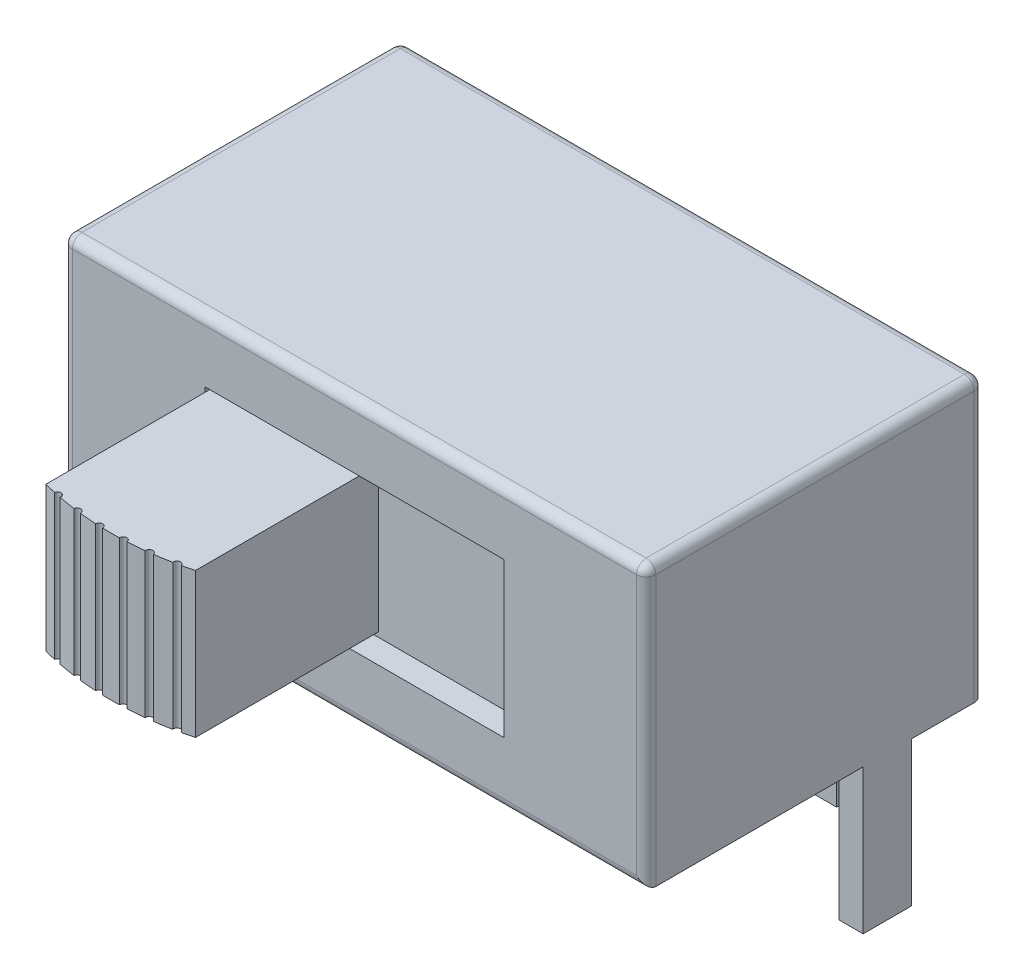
from build123d import *

# Parameters (mm, degrees)
SKETCH_1_W          = 12.1
SKETCH_1_H          = 7
EXTRUDE_1_DEPTH     = 5.8
SKETCH_2_W          = 0.5
SKETCH_2_H          = 1
SKETCH_2_W_2        = 1
SKETCH_2_H_2        = 0.5
EXTRUDE_2_DEPTH     = 3
SKETCH_3_W          = 6.2
SKETCH_3_H          = 3.2
CUT_EXTRUDE_3_DEPTH = 0.5
EXTRUDE_4_DEPTH     = 1.5
FILLET_1_R          = 0.2


with BuildPart() as part:
    # Sketch 1 → Extrude 1 (new body)
    with BuildSketch(Plane(origin=(0, 0, 0), x_dir=(1, 0, 0), z_dir=(0, 1, 0))):
        with Locations((0, 3.5)):
            Rectangle(SKETCH_1_W, SKETCH_1_H)
    extrude(amount=EXTRUDE_1_DEPTH)

    # Sketch 2 → Extrude 2 (add)
    with BuildSketch(Plane.XZ):
        with Locations((-5.8, -5)):
            Rectangle(SKETCH_2_W, SKETCH_2_H)
        with Locations((0, -6.75)):
            Rectangle(SKETCH_2_W_2, SKETCH_2_H_2)
        with Locations((-3, -6.75)):
            Rectangle(SKETCH_2_W_2, SKETCH_2_H_2)
        with Locations((3, -6.75)):
            Rectangle(SKETCH_2_W_2, SKETCH_2_H_2)
        with Locations((5.8, -5)):
            Rectangle(SKETCH_2_W, SKETCH_2_H)
    extrude(amount=EXTRUDE_2_DEPTH)

    # Sketch 3 → Cut-Extrude 3 (cut)
    with BuildSketch(Plane.XY):
        with Locations((0, 2.9)):
            Rectangle(SKETCH_3_W, SKETCH_3_H)
    extrude(amount=-CUT_EXTRUDE_3_DEPTH, mode=Mode.SUBTRACT)

    # Sketch 4 → Extrude 4 (add, symmetric)
    with BuildSketch(Plane(origin=(0, 2.9, 2.4), x_dir=(1, 0, 0), z_dir=(0, 1, 0))):
        with BuildLine():
            Line((-3.1, 2.9), (0, 2.9))
            Line((0, 2.9), (0, -0.896335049))
            ThreePointArc((0, -0.896335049), (-0.117402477, -0.92646242), (-0.235389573, -0.95421211))
            ThreePointArc((-0.235389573, -0.95421211), (-0.324185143, -0.896809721), (-0.382141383, -0.985244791))
            ThreePointArc((-0.382141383, -0.985244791), (-0.554337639, -1.016811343), (-0.727381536, -1.043340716))
            ThreePointArc((-0.727381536, -1.043340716), (-0.81108941, -0.978744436), (-0.876207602, -1.062046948))
            ThreePointArc((-0.876207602, -1.062046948), (-1.050434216, -1.079166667), (-1.225086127, -1.091196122))
            ThreePointArc((-1.225086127, -1.091196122), (-1.303125, -1.019854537), (-1.374952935, -1.097446))
            ThreePointArc((-1.374952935, -1.097446), (-1.55, -1.1), (-1.725047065, -1.097446))
            ThreePointArc((-1.725047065, -1.097446), (-1.796875, -1.019854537), (-1.874913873, -1.091196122))
            ThreePointArc((-1.874913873, -1.091196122), (-2.049565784, -1.079166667), (-2.223792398, -1.062046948))
            ThreePointArc((-2.223792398, -1.062046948), (-2.28891059, -0.978744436), (-2.372618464, -1.043340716))
            ThreePointArc((-2.372618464, -1.043340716), (-2.545662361, -1.016811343), (-2.717858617, -0.985244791))
            ThreePointArc((-2.717858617, -0.985244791), (-2.775814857, -0.896809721), (-2.864610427, -0.95421211))
            ThreePointArc((-2.864610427, -0.95421211), (-2.982597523, -0.92646242), (-3.1, -0.896335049))
            Line((-3.1, -0.896335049), (-3.1, 2.9))
        make_face()
    extrude(amount=EXTRUDE_4_DEPTH, both=True)

    # Fillet 1
    fillet_1_edges = [part.edges().sort_by_distance(p)[0] for p in [
        (0, 5.8, -7),
        (6.05, 5.8, -3.5),
        (0, 5.8, 0),
        (-6.05, 5.8, -3.5),
        (0, 0, 0),
        (-6.05, 2.9, -7),
        (-6.05, 2.9, 0),
        (6.05, 2.9, -7),
        (6.05, 2.9, 0),
    ]]
    fillet(fillet_1_edges, radius=FILLET_1_R)


solid = part.part
